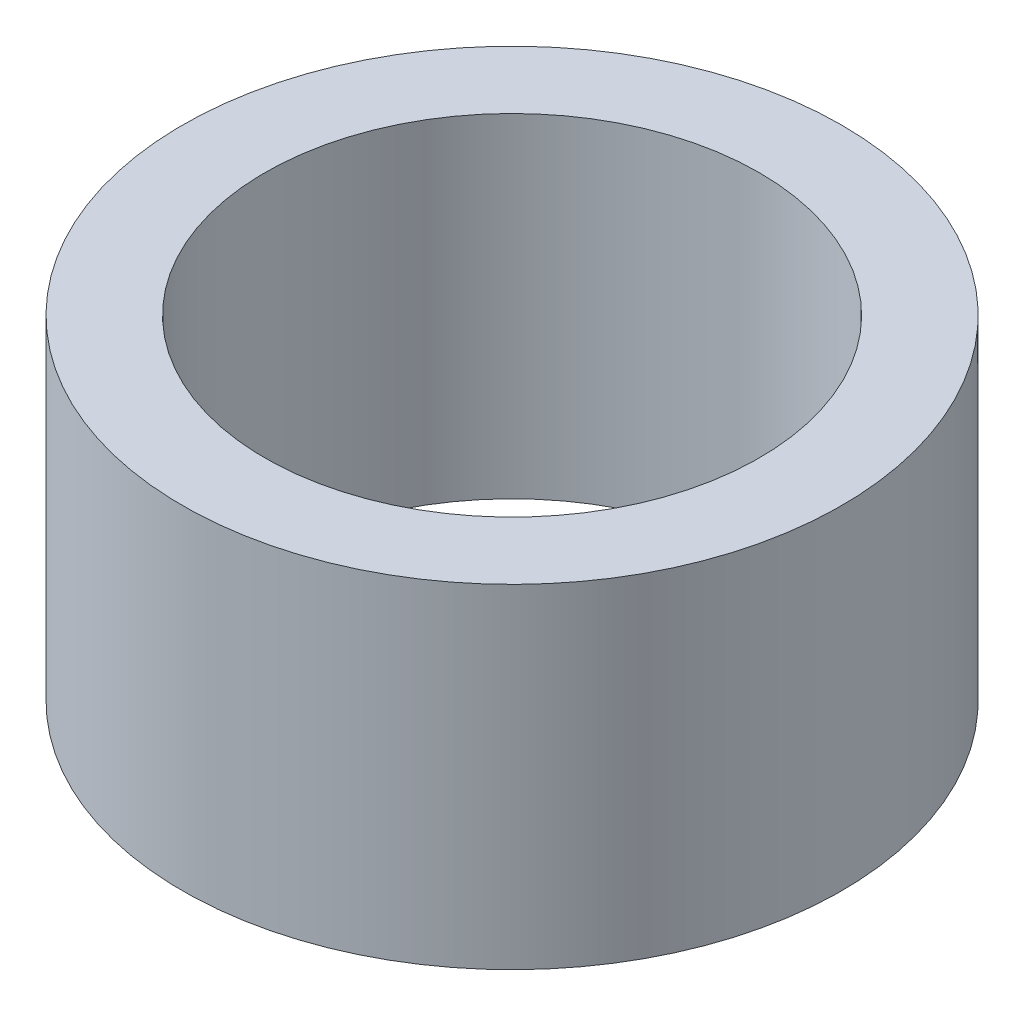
from build123d import *

# Parameters (mm, degrees)
ESQUISSE1_W = 1
ESQUISSE1_H = 4.05


with BuildPart() as part:
    # Esquisse1 → R_volution1 (revolve)
    with BuildSketch(Plane.XY, mode=Mode.PRIVATE) as r_volution1_sk:
        with Locations((3.5, 2.025)):
            Rectangle(ESQUISSE1_W, ESQUISSE1_H)
    revolve(r_volution1_sk.sketch.rotate(Axis((0, 4.05, 0), (0, -1, 0)), 270), axis=Axis((0, 4.05, 0), (0, -1, 0)))


solid = part.part
